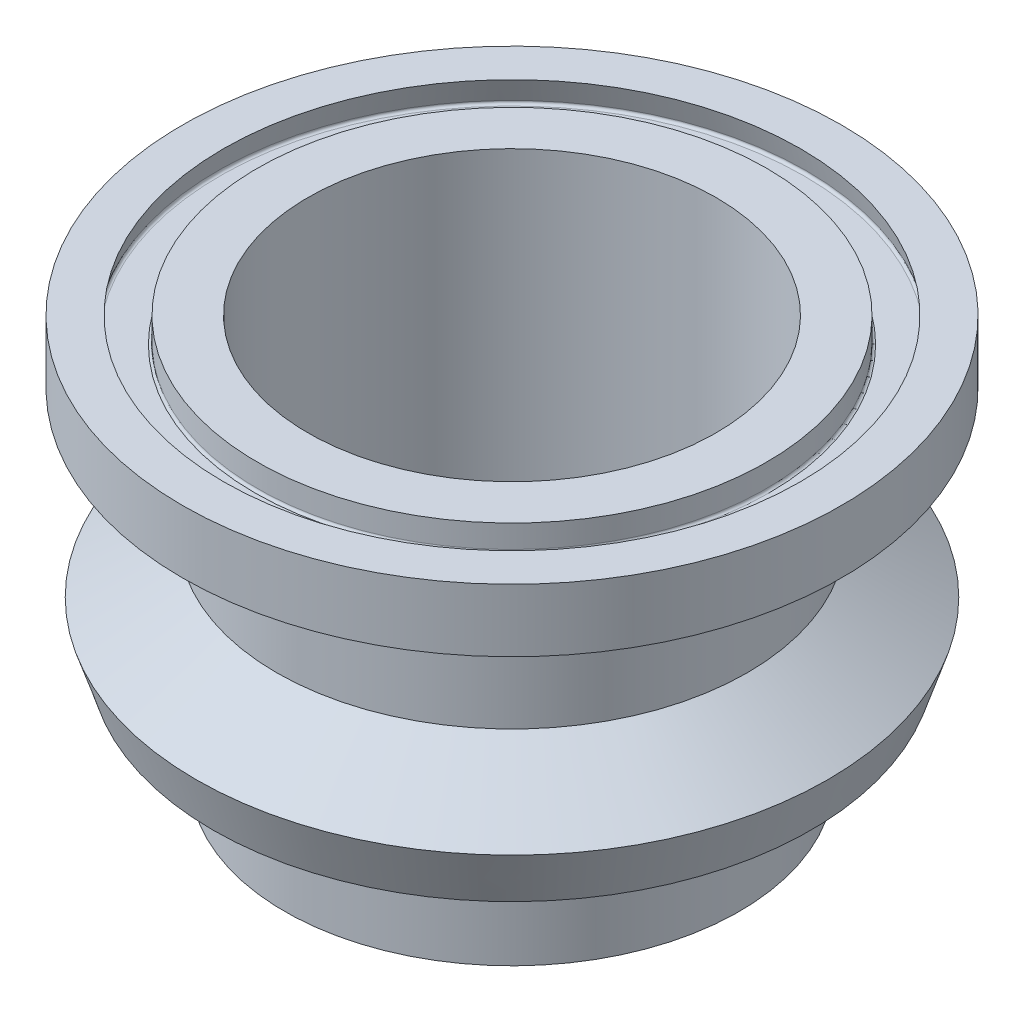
from build123d import *


with BuildPart() as part:
    # Sketch1 → Revolve1 (revolve)
    with BuildSketch(Plane.XY, mode=Mode.PRIVATE) as revolve1_sk:
        with BuildLine():
            Line((33.3375, 127), (33.3375, 120.65))
            Line((33.3375, 120.65), (23.8125, 120.65))
            Line((23.8125, 120.65), (23.8125, 107.583074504))
            Line((23.8125, 107.583074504), (31.959144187, 102.29258191))
            Line((31.959144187, 102.29258191), (30.241995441, 97.007741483))
            Line((30.241995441, 97.007741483), (28.884987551, 97.454164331))
            Line((28.884987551, 97.454164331), (30.059068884, 99.487732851))
            ThreePointArc((30.059068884, 99.487732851), (30.073763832, 99.711934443), (29.904838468, 99.860078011))
            Line((29.904838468, 99.860078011), (26.495332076, 100.773652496))
            ThreePointArc((26.495332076, 100.773652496), (26.302592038, 100.748277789), (26.184246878, 100.594047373))
            Line((26.184246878, 100.594047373), (25.586012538, 98.361406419))
            Line((25.586012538, 98.361406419), (22.9997, 98.962486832))
            Line((22.9997, 98.962486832), (22.9997, 86.262486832))
            Line((22.9997, 86.262486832), (20.6375, 86.262486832))
            Line((20.6375, 86.262486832), (20.6375, 127))
            Line((20.6375, 127), (25.7556, 127))
            Line((25.7556, 127), (25.7556, 124.6886))
            ThreePointArc((25.7556, 124.6886), (25.829994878, 124.508994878), (26.0096, 124.4346))
            Line((26.0096, 124.4346), (29.539380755, 124.4346))
            ThreePointArc((29.539380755, 124.4346), (29.740892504, 124.533974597), (29.784725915, 124.754340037))
            Line((29.784725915, 124.754340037), (29.183003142, 127))
            Line((29.183003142, 127), (33.3375, 127))
        make_face()
    revolve(revolve1_sk.sketch.rotate(Axis((0, 0, 0), (0, 1, 0)), 90), axis=Axis((0, 0, 0), (0, 1, 0)))


solid = part.part
